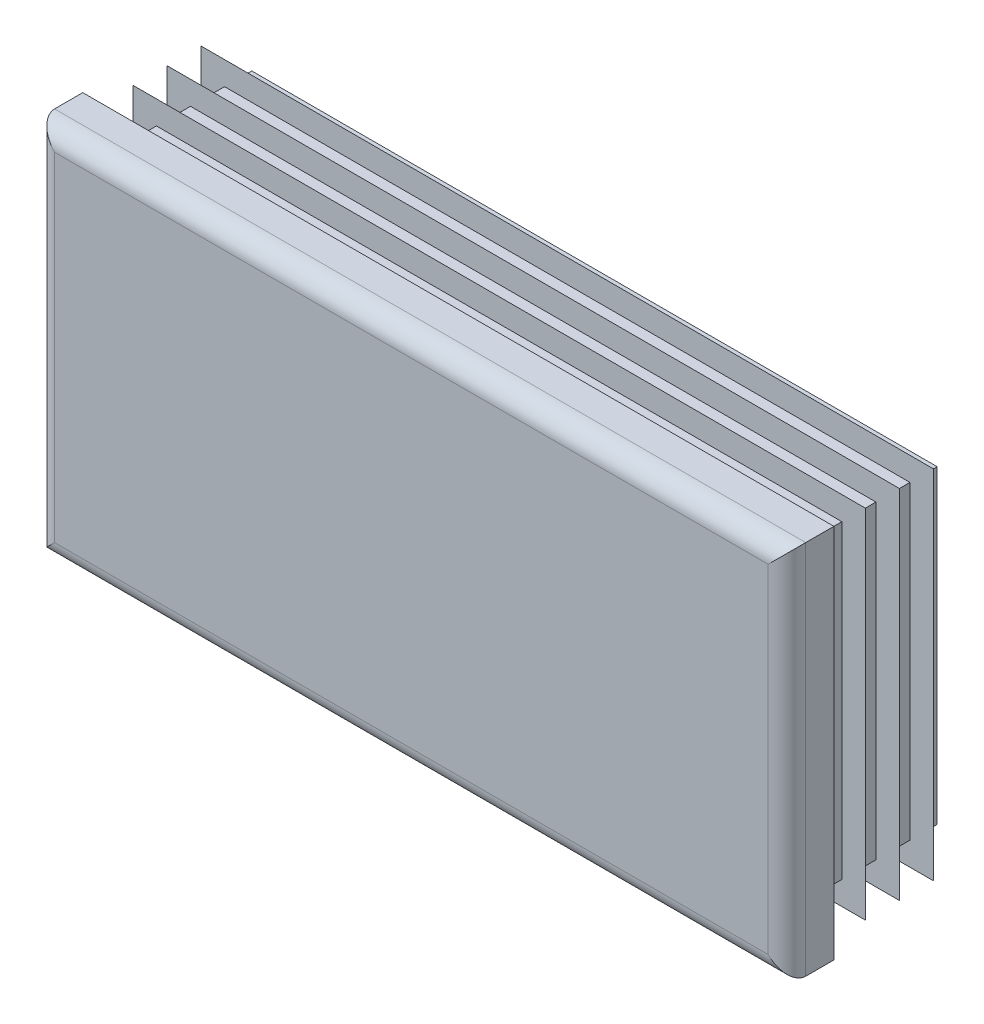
ISO-10303-21;
HEADER;
FILE_DESCRIPTION(('STEP AP214'),'2;1');
FILE_NAME('part.step','',(''),(''),'','','');
FILE_SCHEMA(('AUTOMOTIVE_DESIGN { 1 0 10303 214 1 1 1 1 }'));
ENDSEC;
DATA;
#1=APPLICATION_CONTEXT('core data for automotive mechanical design processes');
#2=APPLICATION_PROTOCOL_DEFINITION('international standard','automotive_design',2000,#1);
#3=PRODUCT_CONTEXT('',#1,'mechanical');
#4=PRODUCT('Part','Part','',(#3));
#5=PRODUCT_RELATED_PRODUCT_CATEGORY('part','',(#4));
#6=PRODUCT_DEFINITION_FORMATION('','',#4);
#7=PRODUCT_DEFINITION_CONTEXT('part definition',#1,'design');
#8=PRODUCT_DEFINITION('design','',#6,#7);
#9=PRODUCT_DEFINITION_SHAPE('','',#8);
#10=(LENGTH_UNIT() NAMED_UNIT(*) SI_UNIT(.MILLI.,.METRE.));
#11=(NAMED_UNIT(*) PLANE_ANGLE_UNIT() SI_UNIT($,.RADIAN.));
#12=(NAMED_UNIT(*) SI_UNIT($,.STERADIAN.) SOLID_ANGLE_UNIT());
#13=UNCERTAINTY_MEASURE_WITH_UNIT(LENGTH_MEASURE(1.E-05),#10,'distance_accuracy_value','');
#14=(GEOMETRIC_REPRESENTATION_CONTEXT(3) GLOBAL_UNCERTAINTY_ASSIGNED_CONTEXT((#13)) GLOBAL_UNIT_ASSIGNED_CONTEXT((#10,
#11,#12)) REPRESENTATION_CONTEXT('',''));
#15=CARTESIAN_POINT('',(0.,0.,0.));
#16=DIRECTION('',(0.,0.,1.));
#17=DIRECTION('',(1.,0.,0.));
#18=AXIS2_PLACEMENT_3D('',#15,#16,#17);
#19=CARTESIAN_POINT('',(38.,-20.,5.));
#20=DIRECTION('',(0.,0.,-1.));
#21=DIRECTION('',(0.,1.,0.));
#22=AXIS2_PLACEMENT_3D('',#19,#20,#21);
#23=PLANE('',#22);
#24=DIRECTION('',(0.,1.,0.));
#25=VECTOR('',#24,1.);
#26=CARTESIAN_POINT('',(-38.,-20.,5.));
#27=LINE('',#26,#25);
#28=CARTESIAN_POINT('',(-38.,-18.,5.));
#29=VERTEX_POINT('',#28);
#30=CARTESIAN_POINT('',(-38.,18.,5.));
#31=VERTEX_POINT('',#30);
#32=EDGE_CURVE('E310',#29,#31,#27,.T.);
#33=ORIENTED_EDGE('',*,*,#32,.F.);
#34=DIRECTION('',(-1.,0.,0.));
#35=VECTOR('',#34,1.);
#36=CARTESIAN_POINT('',(40.,-18.,5.));
#37=LINE('',#36,#35);
#38=CARTESIAN_POINT('',(38.,-18.,5.));
#39=VERTEX_POINT('',#38);
#40=EDGE_CURVE('E482',#39,#29,#37,.T.);
#41=ORIENTED_EDGE('',*,*,#40,.F.);
#42=DIRECTION('',(0.,1.,0.));
#43=VECTOR('',#42,1.);
#44=CARTESIAN_POINT('',(38.,-20.,5.));
#45=LINE('',#44,#43);
#46=CARTESIAN_POINT('',(38.,18.,5.));
#47=VERTEX_POINT('',#46);
#48=EDGE_CURVE('E305',#39,#47,#45,.T.);
#49=ORIENTED_EDGE('',*,*,#48,.T.);
#50=DIRECTION('',(-1.,0.,0.));
#51=VECTOR('',#50,1.);
#52=CARTESIAN_POINT('',(40.,18.,5.));
#53=LINE('',#52,#51);
#54=EDGE_CURVE('E630',#47,#31,#53,.T.);
#55=ORIENTED_EDGE('',*,*,#54,.T.);
#56=EDGE_LOOP('',(#33,#41,#49,#55));
#57=FACE_BOUND('',#56,.T.);
#58=ADVANCED_FACE('F14',(#57),#23,.F.);
#59=CARTESIAN_POINT('',(-38.,-20.,3.));
#60=DIRECTION('',(0.,1.,0.));
#61=DIRECTION('',(-1.,0.,0.));
#62=AXIS2_PLACEMENT_3D('',#59,#60,#61);
#63=CYLINDRICAL_SURFACE('',#62,2.);
#64=DIRECTION('',(0.,1.,0.));
#65=VECTOR('',#64,1.);
#66=CARTESIAN_POINT('',(-40.,-20.,3.));
#67=LINE('',#66,#65);
#68=CARTESIAN_POINT('',(-40.,-20.,3.));
#69=VERTEX_POINT('',#68);
#70=CARTESIAN_POINT('',(-40.,20.,3.));
#71=VERTEX_POINT('',#70);
#72=EDGE_CURVE('E402',#69,#71,#67,.T.);
#73=ORIENTED_EDGE('',*,*,#72,.F.);
#74=CARTESIAN_POINT('',(-38.,-18.,3.));
#75=DIRECTION('',(-0.707106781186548,0.707106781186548,0.));
#76=DIRECTION('',(0.707106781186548,0.707106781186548,0.));
#77=AXIS2_PLACEMENT_3D('',#74,#75,#76);
#78=ELLIPSE('',#77,2.82842712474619,2.);
#79=EDGE_CURVE('E59',#69,#29,#78,.T.);
#80=ORIENTED_EDGE('',*,*,#79,.T.);
#81=ORIENTED_EDGE('',*,*,#32,.T.);
#82=CARTESIAN_POINT('',(-38.,18.,3.));
#83=DIRECTION('',(0.707106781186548,0.707106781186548,0.));
#84=DIRECTION('',(-0.707106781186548,0.707106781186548,0.));
#85=AXIS2_PLACEMENT_3D('',#82,#83,#84);
#86=ELLIPSE('',#85,2.82842712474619,2.);
#87=EDGE_CURVE('E306',#31,#71,#86,.F.);
#88=ORIENTED_EDGE('',*,*,#87,.T.);
#89=EDGE_LOOP('',(#73,#80,#81,#88));
#90=FACE_BOUND('',#89,.T.);
#91=ADVANCED_FACE('F16',(#90),#63,.T.);
#92=CARTESIAN_POINT('',(-40.,-20.,3.));
#93=DIRECTION('',(1.,0.,0.));
#94=DIRECTION('',(0.,1.,0.));
#95=AXIS2_PLACEMENT_3D('',#92,#93,#94);
#96=PLANE('',#95);
#97=DIRECTION('',(0.,0.,-1.));
#98=VECTOR('',#97,1.);
#99=CARTESIAN_POINT('',(-40.,20.,3.));
#100=LINE('',#99,#98);
#101=CARTESIAN_POINT('',(-40.,20.,0.));
#102=VERTEX_POINT('',#101);
#103=EDGE_CURVE('E615',#71,#102,#100,.T.);
#104=ORIENTED_EDGE('',*,*,#103,.T.);
#105=DIRECTION('',(0.,1.,0.));
#106=VECTOR('',#105,1.);
#107=CARTESIAN_POINT('',(-40.,-20.,0.));
#108=LINE('',#107,#106);
#109=CARTESIAN_POINT('',(-40.,-20.,0.));
#110=VERTEX_POINT('',#109);
#111=EDGE_CURVE('E400',#110,#102,#108,.T.);
#112=ORIENTED_EDGE('',*,*,#111,.F.);
#113=DIRECTION('',(0.,0.,-1.));
#114=VECTOR('',#113,1.);
#115=CARTESIAN_POINT('',(-40.,-20.,3.));
#116=LINE('',#115,#114);
#117=EDGE_CURVE('E616',#69,#110,#116,.T.);
#118=ORIENTED_EDGE('',*,*,#117,.F.);
#119=ORIENTED_EDGE('',*,*,#72,.T.);
#120=EDGE_LOOP('',(#104,#112,#118,#119));
#121=FACE_BOUND('',#120,.T.);
#122=ADVANCED_FACE('F697',(#121),#96,.F.);
#123=CARTESIAN_POINT('',(-36.5,-20.,0.));
#124=DIRECTION('',(1.,0.,0.));
#125=DIRECTION('',(0.,1.,0.));
#126=AXIS2_PLACEMENT_3D('',#123,#124,#125);
#127=PLANE('',#126);
#128=DIRECTION('',(0.,1.,0.));
#129=VECTOR('',#128,1.);
#130=CARTESIAN_POINT('',(-36.5,-20.,0.));
#131=LINE('',#130,#129);
#132=CARTESIAN_POINT('',(-36.5,-16.5,0.));
#133=VERTEX_POINT('',#132);
#134=CARTESIAN_POINT('',(-36.5,16.5,0.));
#135=VERTEX_POINT('',#134);
#136=EDGE_CURVE('E397',#133,#135,#131,.T.);
#137=ORIENTED_EDGE('',*,*,#136,.T.);
#138=DIRECTION('',(0.,0.,-1.));
#139=VECTOR('',#138,1.);
#140=CARTESIAN_POINT('',(-36.5,16.5,0.));
#141=LINE('',#140,#139);
#142=CARTESIAN_POINT('',(-36.5,16.5,-0.725));
#143=VERTEX_POINT('',#142);
#144=EDGE_CURVE('E495',#135,#143,#141,.T.);
#145=ORIENTED_EDGE('',*,*,#144,.T.);
#146=DIRECTION('',(0.,1.,0.));
#147=VECTOR('',#146,1.);
#148=CARTESIAN_POINT('',(-36.5,-20.,-0.725));
#149=LINE('',#148,#147);
#150=CARTESIAN_POINT('',(-36.5,-16.5,-0.725));
#151=VERTEX_POINT('',#150);
#152=EDGE_CURVE('E394',#151,#143,#149,.T.);
#153=ORIENTED_EDGE('',*,*,#152,.F.);
#154=DIRECTION('',(0.,0.,1.));
#155=VECTOR('',#154,1.);
#156=CARTESIAN_POINT('',(-36.5,-16.5,0.));
#157=LINE('',#156,#155);
#158=EDGE_CURVE('E489',#151,#133,#157,.T.);
#159=ORIENTED_EDGE('',*,*,#158,.T.);
#160=EDGE_LOOP('',(#137,#145,#153,#159));
#161=FACE_BOUND('',#160,.T.);
#162=ADVANCED_FACE('F787',(#161),#127,.F.);
#163=CARTESIAN_POINT('',(-39.,-20.,-0.725));
#164=DIRECTION('',(0.34202014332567,0.,0.939692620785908));
#165=DIRECTION('',(-0.939692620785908,0.,0.34202014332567));
#166=AXIS2_PLACEMENT_3D('',#163,#164,#165);
#167=PLANE('',#166);
#168=DIRECTION('',(0.,1.,0.));
#169=VECTOR('',#168,1.);
#170=CARTESIAN_POINT('',(-39.,-20.,-0.725));
#171=LINE('',#170,#169);
#172=CARTESIAN_POINT('',(-39.,-19.,-0.725));
#173=VERTEX_POINT('',#172);
#174=CARTESIAN_POINT('',(-39.,19.,-0.725));
#175=VERTEX_POINT('',#174);
#176=EDGE_CURVE('E392',#173,#175,#171,.T.);
#177=ORIENTED_EDGE('',*,*,#176,.T.);
#178=DIRECTION('',(0.844349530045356,-0.438895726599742,-0.307318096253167));
#179=VECTOR('',#178,1.);
#180=CARTESIAN_POINT('',(-24.5473253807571,11.4874511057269,-5.98534336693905));
#181=LINE('',#180,#179);
#182=CARTESIAN_POINT('',(-36.5,17.7004915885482,-1.63492558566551));
#183=VERTEX_POINT('',#182);
#184=EDGE_CURVE('E519',#175,#183,#181,.T.);
#185=ORIENTED_EDGE('',*,*,#184,.T.);
#186=DIRECTION('',(0.,1.,0.));
#187=VECTOR('',#186,1.);
#188=CARTESIAN_POINT('',(-36.5,-20.,-1.63492558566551));
#189=LINE('',#188,#187);
#190=CARTESIAN_POINT('',(-36.5,-17.7004915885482,-1.63492558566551));
#191=VERTEX_POINT('',#190);
#192=EDGE_CURVE('E389',#191,#183,#189,.T.);
#193=ORIENTED_EDGE('',*,*,#192,.F.);
#194=DIRECTION('',(-0.844349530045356,-0.438895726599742,0.307318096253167));
#195=VECTOR('',#194,1.);
#196=CARTESIAN_POINT('',(-39.3705814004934,-19.1926294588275,-0.590119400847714));
#197=LINE('',#196,#195);
#198=EDGE_CURVE('E507',#191,#173,#197,.T.);
#199=ORIENTED_EDGE('',*,*,#198,.T.);
#200=EDGE_LOOP('',(#177,#185,#193,#199));
#201=FACE_BOUND('',#200,.T.);
#202=ADVANCED_FACE('F783',(#201),#167,.F.);
#203=CARTESIAN_POINT('',(-36.5,-20.,-1.63492558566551));
#204=DIRECTION('',(1.,0.,0.));
#205=DIRECTION('',(0.,1.,0.));
#206=AXIS2_PLACEMENT_3D('',#203,#204,#205);
#207=PLANE('',#206);
#208=ORIENTED_EDGE('',*,*,#192,.T.);
#209=DIRECTION('',(0.,-0.819152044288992,-0.573576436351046));
#210=VECTOR('',#209,1.);
#211=CARTESIAN_POINT('',(-36.5,-7.59691797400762,-19.3483624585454));
#212=LINE('',#211,#210);
#213=CARTESIAN_POINT('',(-36.5,16.5,-2.47551884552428));
#214=VERTEX_POINT('',#213);
#215=EDGE_CURVE('E516',#183,#214,#212,.T.);
#216=ORIENTED_EDGE('',*,*,#215,.T.);
#217=DIRECTION('',(0.,0.,-1.));
#218=VECTOR('',#217,1.);
#219=CARTESIAN_POINT('',(-36.5,16.5,-1.63492558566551));
#220=LINE('',#219,#218);
#221=CARTESIAN_POINT('',(-36.5,16.5,-4.35));
#222=VERTEX_POINT('',#221);
#223=EDGE_CURVE('E525',#214,#222,#220,.T.);
#224=ORIENTED_EDGE('',*,*,#223,.T.);
#225=DIRECTION('',(0.,1.,0.));
#226=VECTOR('',#225,1.);
#227=CARTESIAN_POINT('',(-36.5,-20.,-4.35));
#228=LINE('',#227,#226);
#229=CARTESIAN_POINT('',(-36.5,-16.5,-4.35));
#230=VERTEX_POINT('',#229);
#231=EDGE_CURVE('E386',#230,#222,#228,.T.);
#232=ORIENTED_EDGE('',*,*,#231,.F.);
#233=DIRECTION('',(0.,0.,1.));
#234=VECTOR('',#233,1.);
#235=CARTESIAN_POINT('',(-36.5,-16.5,-1.63492558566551));
#236=LINE('',#235,#234);
#237=CARTESIAN_POINT('',(-36.5,-16.5,-2.47551884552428));
#238=VERTEX_POINT('',#237);
#239=EDGE_CURVE('E522',#230,#238,#236,.T.);
#240=ORIENTED_EDGE('',*,*,#239,.T.);
#241=DIRECTION('',(0.,-0.819152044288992,0.573576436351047));
#242=VECTOR('',#241,1.);
#243=CARTESIAN_POINT('',(-36.5,-19.2434848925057,-0.554510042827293));
#244=LINE('',#243,#242);
#245=EDGE_CURVE('E504',#238,#191,#244,.T.);
#246=ORIENTED_EDGE('',*,*,#245,.T.);
#247=EDGE_LOOP('',(#208,#216,#224,#232,#240,#246));
#248=FACE_BOUND('',#247,.T.);
#249=ADVANCED_FACE('F779',(#248),#207,.F.);
#250=CARTESIAN_POINT('',(-39.,-20.,-4.35));
#251=DIRECTION('',(0.34202014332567,0.,0.939692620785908));
#252=DIRECTION('',(-0.939692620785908,0.,0.34202014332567));
#253=AXIS2_PLACEMENT_3D('',#250,#251,#252);
#254=PLANE('',#253);
#255=DIRECTION('',(0.,1.,0.));
#256=VECTOR('',#255,1.);
#257=CARTESIAN_POINT('',(-39.,-20.,-4.35));
#258=LINE('',#257,#256);
#259=CARTESIAN_POINT('',(-39.,-19.,-4.35));
#260=VERTEX_POINT('',#259);
#261=CARTESIAN_POINT('',(-39.,19.,-4.35));
#262=VERTEX_POINT('',#261);
#263=EDGE_CURVE('E384',#260,#262,#258,.T.);
#264=ORIENTED_EDGE('',*,*,#263,.T.);
#265=DIRECTION('',(0.844349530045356,-0.438895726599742,-0.307318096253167));
#266=VECTOR('',#265,1.);
#267=CARTESIAN_POINT('',(-24.5473253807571,11.4874511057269,-9.61034336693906));
#268=LINE('',#267,#266);
#269=CARTESIAN_POINT('',(-36.5,17.7004915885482,-5.25992558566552));
#270=VERTEX_POINT('',#269);
#271=EDGE_CURVE('E549',#262,#270,#268,.T.);
#272=ORIENTED_EDGE('',*,*,#271,.T.);
#273=DIRECTION('',(0.,1.,0.));
#274=VECTOR('',#273,1.);
#275=CARTESIAN_POINT('',(-36.5,-20.,-5.25992558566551));
#276=LINE('',#275,#274);
#277=CARTESIAN_POINT('',(-36.5,-17.7004915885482,-5.25992558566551));
#278=VERTEX_POINT('',#277);
#279=EDGE_CURVE('E381',#278,#270,#276,.T.);
#280=ORIENTED_EDGE('',*,*,#279,.F.);
#281=DIRECTION('',(-0.844349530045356,-0.438895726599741,0.307318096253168));
#282=VECTOR('',#281,1.);
#283=CARTESIAN_POINT('',(-39.3705814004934,-19.1926294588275,-4.21511940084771));
#284=LINE('',#283,#282);
#285=EDGE_CURVE('E537',#278,#260,#284,.T.);
#286=ORIENTED_EDGE('',*,*,#285,.T.);
#287=EDGE_LOOP('',(#264,#272,#280,#286));
#288=FACE_BOUND('',#287,.T.);
#289=ADVANCED_FACE('F775',(#288),#254,.F.);
#290=CARTESIAN_POINT('',(-36.5,-20.,-5.25992558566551));
#291=DIRECTION('',(1.,0.,0.));
#292=DIRECTION('',(0.,1.,0.));
#293=AXIS2_PLACEMENT_3D('',#290,#291,#292);
#294=PLANE('',#293);
#295=ORIENTED_EDGE('',*,*,#279,.T.);
#296=DIRECTION('',(0.,-0.819152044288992,-0.573576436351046));
#297=VECTOR('',#296,1.);
#298=CARTESIAN_POINT('',(-36.5,-7.59691797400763,-22.9733624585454));
#299=LINE('',#298,#297);
#300=CARTESIAN_POINT('',(-36.5,16.5,-6.10051884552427));
#301=VERTEX_POINT('',#300);
#302=EDGE_CURVE('E546',#270,#301,#299,.T.);
#303=ORIENTED_EDGE('',*,*,#302,.T.);
#304=DIRECTION('',(0.,0.,-1.));
#305=VECTOR('',#304,1.);
#306=CARTESIAN_POINT('',(-36.5,16.5,-5.25992558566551));
#307=LINE('',#306,#305);
#308=CARTESIAN_POINT('',(-36.5,16.5,-7.975));
#309=VERTEX_POINT('',#308);
#310=EDGE_CURVE('E555',#301,#309,#307,.T.);
#311=ORIENTED_EDGE('',*,*,#310,.T.);
#312=DIRECTION('',(0.,1.,0.));
#313=VECTOR('',#312,1.);
#314=CARTESIAN_POINT('',(-36.5,-20.,-7.975));
#315=LINE('',#314,#313);
#316=CARTESIAN_POINT('',(-36.5,-16.5,-7.975));
#317=VERTEX_POINT('',#316);
#318=EDGE_CURVE('E378',#317,#309,#315,.T.);
#319=ORIENTED_EDGE('',*,*,#318,.F.);
#320=DIRECTION('',(0.,0.,1.));
#321=VECTOR('',#320,1.);
#322=CARTESIAN_POINT('',(-36.5,-16.5,-5.25992558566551));
#323=LINE('',#322,#321);
#324=CARTESIAN_POINT('',(-36.5,-16.5,-6.10051884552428));
#325=VERTEX_POINT('',#324);
#326=EDGE_CURVE('E552',#317,#325,#323,.T.);
#327=ORIENTED_EDGE('',*,*,#326,.T.);
#328=DIRECTION('',(0.,-0.819152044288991,0.573576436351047));
#329=VECTOR('',#328,1.);
#330=CARTESIAN_POINT('',(-36.5,-19.2434848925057,-4.17951004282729));
#331=LINE('',#330,#329);
#332=EDGE_CURVE('E534',#325,#278,#331,.T.);
#333=ORIENTED_EDGE('',*,*,#332,.T.);
#334=EDGE_LOOP('',(#295,#303,#311,#319,#327,#333));
#335=FACE_BOUND('',#334,.T.);
#336=ADVANCED_FACE('F771',(#335),#294,.F.);
#337=CARTESIAN_POINT('',(-39.,-20.,-7.975));
#338=DIRECTION('',(0.342020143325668,0.,0.939692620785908));
#339=DIRECTION('',(-0.939692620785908,0.,0.342020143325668));
#340=AXIS2_PLACEMENT_3D('',#337,#338,#339);
#341=PLANE('',#340);
#342=DIRECTION('',(0.,1.,0.));
#343=VECTOR('',#342,1.);
#344=CARTESIAN_POINT('',(-39.,-20.,-7.975));
#345=LINE('',#344,#343);
#346=CARTESIAN_POINT('',(-39.,-19.,-7.975));
#347=VERTEX_POINT('',#346);
#348=CARTESIAN_POINT('',(-39.,19.,-7.975));
#349=VERTEX_POINT('',#348);
#350=EDGE_CURVE('E376',#347,#349,#345,.T.);
#351=ORIENTED_EDGE('',*,*,#350,.T.);
#352=DIRECTION('',(0.844349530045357,-0.43889572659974,-0.307318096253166));
#353=VECTOR('',#352,1.);
#354=CARTESIAN_POINT('',(-24.5473253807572,11.4874511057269,-13.235343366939));
#355=LINE('',#354,#353);
#356=CARTESIAN_POINT('',(-36.5,17.7004915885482,-8.88492558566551));
#357=VERTEX_POINT('',#356);
#358=EDGE_CURVE('E579',#349,#357,#355,.T.);
#359=ORIENTED_EDGE('',*,*,#358,.T.);
#360=DIRECTION('',(0.,1.,0.));
#361=VECTOR('',#360,1.);
#362=CARTESIAN_POINT('',(-36.5,-20.,-8.88492558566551));
#363=LINE('',#362,#361);
#364=CARTESIAN_POINT('',(-36.5,-17.7004915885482,-8.88492558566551));
#365=VERTEX_POINT('',#364);
#366=EDGE_CURVE('E373',#365,#357,#363,.T.);
#367=ORIENTED_EDGE('',*,*,#366,.F.);
#368=DIRECTION('',(-0.844349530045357,-0.438895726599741,0.307318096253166));
#369=VECTOR('',#368,1.);
#370=CARTESIAN_POINT('',(-39.3705814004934,-19.1926294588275,-7.84011940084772));
#371=LINE('',#370,#369);
#372=EDGE_CURVE('E567',#365,#347,#371,.T.);
#373=ORIENTED_EDGE('',*,*,#372,.T.);
#374=EDGE_LOOP('',(#351,#359,#367,#373));
#375=FACE_BOUND('',#374,.T.);
#376=ADVANCED_FACE('F767',(#375),#341,.F.);
#377=CARTESIAN_POINT('',(-36.5,-20.,-8.88492558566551));
#378=DIRECTION('',(1.,0.,0.));
#379=DIRECTION('',(0.,1.,0.));
#380=AXIS2_PLACEMENT_3D('',#377,#378,#379);
#381=PLANE('',#380);
#382=ORIENTED_EDGE('',*,*,#366,.T.);
#383=DIRECTION('',(0.,-0.819152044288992,-0.573576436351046));
#384=VECTOR('',#383,1.);
#385=CARTESIAN_POINT('',(-36.5,-7.59691797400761,-26.5983624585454));
#386=LINE('',#385,#384);
#387=CARTESIAN_POINT('',(-36.5,16.5,-9.72551884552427));
#388=VERTEX_POINT('',#387);
#389=EDGE_CURVE('E576',#357,#388,#386,.T.);
#390=ORIENTED_EDGE('',*,*,#389,.T.);
#391=DIRECTION('',(0.,0.,-1.));
#392=VECTOR('',#391,1.);
#393=CARTESIAN_POINT('',(-36.5,16.5,-8.88492558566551));
#394=LINE('',#393,#392);
#395=CARTESIAN_POINT('',(-36.5,16.5,-11.6));
#396=VERTEX_POINT('',#395);
#397=EDGE_CURVE('E585',#388,#396,#394,.T.);
#398=ORIENTED_EDGE('',*,*,#397,.T.);
#399=DIRECTION('',(0.,1.,0.));
#400=VECTOR('',#399,1.);
#401=CARTESIAN_POINT('',(-36.5,-20.,-11.6));
#402=LINE('',#401,#400);
#403=CARTESIAN_POINT('',(-36.5,-16.5,-11.6));
#404=VERTEX_POINT('',#403);
#405=EDGE_CURVE('E370',#404,#396,#402,.T.);
#406=ORIENTED_EDGE('',*,*,#405,.F.);
#407=DIRECTION('',(0.,0.,1.));
#408=VECTOR('',#407,1.);
#409=CARTESIAN_POINT('',(-36.5,-16.5,-8.88492558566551));
#410=LINE('',#409,#408);
#411=CARTESIAN_POINT('',(-36.5,-16.5,-9.72551884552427));
#412=VERTEX_POINT('',#411);
#413=EDGE_CURVE('E582',#404,#412,#410,.T.);
#414=ORIENTED_EDGE('',*,*,#413,.T.);
#415=DIRECTION('',(0.,-0.819152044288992,0.573576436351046));
#416=VECTOR('',#415,1.);
#417=CARTESIAN_POINT('',(-36.5,-19.2434848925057,-7.80451004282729));
#418=LINE('',#417,#416);
#419=EDGE_CURVE('E564',#412,#365,#418,.T.);
#420=ORIENTED_EDGE('',*,*,#419,.T.);
#421=EDGE_LOOP('',(#382,#390,#398,#406,#414,#420));
#422=FACE_BOUND('',#421,.T.);
#423=ADVANCED_FACE('F764',(#422),#381,.F.);
#424=CARTESIAN_POINT('',(-39.,-20.,-11.6));
#425=DIRECTION('',(0.342020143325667,0.,0.939692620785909));
#426=DIRECTION('',(-0.939692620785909,0.,0.342020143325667));
#427=AXIS2_PLACEMENT_3D('',#424,#425,#426);
#428=PLANE('',#427);
#429=DIRECTION('',(0.,1.,0.));
#430=VECTOR('',#429,1.);
#431=CARTESIAN_POINT('',(-39.,-20.,-11.6));
#432=LINE('',#431,#430);
#433=CARTESIAN_POINT('',(-39.,-19.,-11.6));
#434=VERTEX_POINT('',#433);
#435=CARTESIAN_POINT('',(-39.,19.,-11.6));
#436=VERTEX_POINT('',#435);
#437=EDGE_CURVE('E368',#434,#436,#432,.T.);
#438=ORIENTED_EDGE('',*,*,#437,.T.);
#439=DIRECTION('',(0.844349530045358,-0.438895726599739,-0.307318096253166));
#440=VECTOR('',#439,1.);
#441=CARTESIAN_POINT('',(-24.5473253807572,11.487451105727,-16.860343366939));
#442=LINE('',#441,#440);
#443=CARTESIAN_POINT('',(-36.5,17.7004915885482,-12.5099255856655));
#444=VERTEX_POINT('',#443);
#445=EDGE_CURVE('E607',#436,#444,#442,.T.);
#446=ORIENTED_EDGE('',*,*,#445,.T.);
#447=DIRECTION('',(0.,1.,0.));
#448=VECTOR('',#447,1.);
#449=CARTESIAN_POINT('',(-36.5,-20.,-12.5099255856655));
#450=LINE('',#449,#448);
#451=CARTESIAN_POINT('',(-36.5,-17.7004915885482,-12.5099255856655));
#452=VERTEX_POINT('',#451);
#453=EDGE_CURVE('E365',#452,#444,#450,.T.);
#454=ORIENTED_EDGE('',*,*,#453,.F.);
#455=DIRECTION('',(-0.844349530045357,-0.438895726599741,0.307318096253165));
#456=VECTOR('',#455,1.);
#457=CARTESIAN_POINT('',(-39.3705814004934,-19.1926294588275,-11.4651194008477));
#458=LINE('',#457,#456);
#459=EDGE_CURVE('E595',#452,#434,#458,.T.);
#460=ORIENTED_EDGE('',*,*,#459,.T.);
#461=EDGE_LOOP('',(#438,#446,#454,#460));
#462=FACE_BOUND('',#461,.T.);
#463=ADVANCED_FACE('F675',(#462),#428,.F.);
#464=CARTESIAN_POINT('',(-36.5,-20.,-12.5099255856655));
#465=DIRECTION('',(1.,0.,0.));
#466=DIRECTION('',(0.,1.,0.));
#467=AXIS2_PLACEMENT_3D('',#464,#465,#466);
#468=PLANE('',#467);
#469=ORIENTED_EDGE('',*,*,#453,.T.);
#470=DIRECTION('',(0.,-0.819152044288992,-0.573576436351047));
#471=VECTOR('',#470,1.);
#472=CARTESIAN_POINT('',(-36.5,-7.5969179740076,-30.2233624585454));
#473=LINE('',#472,#471);
#474=CARTESIAN_POINT('',(-36.5,16.5,-13.3505188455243));
#475=VERTEX_POINT('',#474);
#476=EDGE_CURVE('E604',#444,#475,#473,.T.);
#477=ORIENTED_EDGE('',*,*,#476,.T.);
#478=DIRECTION('',(0.,0.,-1.));
#479=VECTOR('',#478,1.);
#480=CARTESIAN_POINT('',(-36.5,16.5,-12.5099255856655));
#481=LINE('',#480,#479);
#482=CARTESIAN_POINT('',(-36.5,16.5,-14.5));
#483=VERTEX_POINT('',#482);
#484=EDGE_CURVE('E613',#475,#483,#481,.T.);
#485=ORIENTED_EDGE('',*,*,#484,.T.);
#486=DIRECTION('',(0.,1.,0.));
#487=VECTOR('',#486,1.);
#488=CARTESIAN_POINT('',(-36.5,-20.,-14.5));
#489=LINE('',#488,#487);
#490=CARTESIAN_POINT('',(-36.5,-16.5,-14.5));
#491=VERTEX_POINT('',#490);
#492=EDGE_CURVE('E362',#491,#483,#489,.T.);
#493=ORIENTED_EDGE('',*,*,#492,.F.);
#494=DIRECTION('',(0.,0.,1.));
#495=VECTOR('',#494,1.);
#496=CARTESIAN_POINT('',(-36.5,-16.5,-12.5099255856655));
#497=LINE('',#496,#495);
#498=CARTESIAN_POINT('',(-36.5,-16.5,-13.3505188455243));
#499=VERTEX_POINT('',#498);
#500=EDGE_CURVE('E610',#491,#499,#497,.T.);
#501=ORIENTED_EDGE('',*,*,#500,.T.);
#502=DIRECTION('',(0.,-0.819152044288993,0.573576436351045));
#503=VECTOR('',#502,1.);
#504=CARTESIAN_POINT('',(-36.5,-19.2434848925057,-11.4295100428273));
#505=LINE('',#504,#503);
#506=EDGE_CURVE('E592',#499,#452,#505,.T.);
#507=ORIENTED_EDGE('',*,*,#506,.T.);
#508=EDGE_LOOP('',(#469,#477,#485,#493,#501,#507));
#509=FACE_BOUND('',#508,.T.);
#510=ADVANCED_FACE('F677',(#509),#468,.F.);
#511=CARTESIAN_POINT('',(-36.5,-20.,-14.5));
#512=DIRECTION('',(0.,0.,1.));
#513=DIRECTION('',(0.,-1.,0.));
#514=AXIS2_PLACEMENT_3D('',#511,#512,#513);
#515=PLANE('',#514);
#516=ORIENTED_EDGE('',*,*,#492,.T.);
#517=DIRECTION('',(-1.,0.,0.));
#518=VECTOR('',#517,1.);
#519=CARTESIAN_POINT('',(40.,16.5,-14.5));
#520=LINE('',#519,#518);
#521=CARTESIAN_POINT('',(36.5,16.5,-14.5));
#522=VERTEX_POINT('',#521);
#523=EDGE_CURVE('E438',#522,#483,#520,.T.);
#524=ORIENTED_EDGE('',*,*,#523,.F.);
#525=DIRECTION('',(0.,1.,0.));
#526=VECTOR('',#525,1.);
#527=CARTESIAN_POINT('',(36.5,-20.,-14.5));
#528=LINE('',#527,#526);
#529=CARTESIAN_POINT('',(36.5,-16.5,-14.5));
#530=VERTEX_POINT('',#529);
#531=EDGE_CURVE('E359',#530,#522,#528,.T.);
#532=ORIENTED_EDGE('',*,*,#531,.F.);
#533=DIRECTION('',(-1.,0.,0.));
#534=VECTOR('',#533,1.);
#535=CARTESIAN_POINT('',(40.,-16.5,-14.5));
#536=LINE('',#535,#534);
#537=EDGE_CURVE('E436',#530,#491,#536,.T.);
#538=ORIENTED_EDGE('',*,*,#537,.T.);
#539=EDGE_LOOP('',(#516,#524,#532,#538));
#540=FACE_BOUND('',#539,.T.);
#541=ADVANCED_FACE('F435',(#540),#515,.F.);
#542=CARTESIAN_POINT('',(36.5,-20.,-14.5));
#543=DIRECTION('',(-1.,0.,0.));
#544=DIRECTION('',(0.,-1.,0.));
#545=AXIS2_PLACEMENT_3D('',#542,#543,#544);
#546=PLANE('',#545);
#547=DIRECTION('',(0.,0.,1.));
#548=VECTOR('',#547,1.);
#549=CARTESIAN_POINT('',(36.5,16.5,-14.5));
#550=LINE('',#549,#548);
#551=CARTESIAN_POINT('',(36.5,16.5,-13.3505188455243));
#552=VERTEX_POINT('',#551);
#553=EDGE_CURVE('E9',#522,#552,#550,.T.);
#554=ORIENTED_EDGE('',*,*,#553,.T.);
#555=DIRECTION('',(0.,0.819152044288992,0.573576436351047));
#556=VECTOR('',#555,1.);
#557=CARTESIAN_POINT('',(36.5,-8.53194709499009,-30.878076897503));
#558=LINE('',#557,#556);
#559=CARTESIAN_POINT('',(36.5,17.7004915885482,-12.5099255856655));
#560=VERTEX_POINT('',#559);
#561=EDGE_CURVE('E601',#552,#560,#558,.T.);
#562=ORIENTED_EDGE('',*,*,#561,.T.);
#563=DIRECTION('',(0.,1.,0.));
#564=VECTOR('',#563,1.);
#565=CARTESIAN_POINT('',(36.5,-20.,-12.5099255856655));
#566=LINE('',#565,#564);
#567=CARTESIAN_POINT('',(36.5,-17.7004915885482,-12.5099255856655));
#568=VERTEX_POINT('',#567);
#569=EDGE_CURVE('E356',#568,#560,#566,.T.);
#570=ORIENTED_EDGE('',*,*,#569,.F.);
#571=DIRECTION('',(0.,0.819152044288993,-0.573576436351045));
#572=VECTOR('',#571,1.);
#573=CARTESIAN_POINT('',(36.5,-18.3084557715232,-12.0842244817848));
#574=LINE('',#573,#572);
#575=CARTESIAN_POINT('',(36.5,-16.5,-13.3505188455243));
#576=VERTEX_POINT('',#575);
#577=EDGE_CURVE('E428',#568,#576,#574,.T.);
#578=ORIENTED_EDGE('',*,*,#577,.T.);
#579=DIRECTION('',(0.,0.,-1.));
#580=VECTOR('',#579,1.);
#581=CARTESIAN_POINT('',(36.5,-16.5,-14.5));
#582=LINE('',#581,#580);
#583=EDGE_CURVE('E23',#576,#530,#582,.T.);
#584=ORIENTED_EDGE('',*,*,#583,.T.);
#585=ORIENTED_EDGE('',*,*,#531,.T.);
#586=EDGE_LOOP('',(#554,#562,#570,#578,#584,#585));
#587=FACE_BOUND('',#586,.T.);
#588=ADVANCED_FACE('F426',(#587),#546,.F.);
#589=CARTESIAN_POINT('',(36.5,-20.,-12.5099255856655));
#590=DIRECTION('',(-0.342020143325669,0.,0.939692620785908));
#591=DIRECTION('',(-0.939692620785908,0.,-0.342020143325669));
#592=AXIS2_PLACEMENT_3D('',#589,#590,#591);
#593=PLANE('',#592);
#594=ORIENTED_EDGE('',*,*,#569,.T.);
#595=DIRECTION('',(0.844349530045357,0.43889572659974,0.307318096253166));
#596=VECTOR('',#595,1.);
#597=CARTESIAN_POINT('',(22.528899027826,10.4382662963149,-17.5949904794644));
#598=LINE('',#597,#596);
#599=CARTESIAN_POINT('',(39.,19.,-11.6));
#600=VERTEX_POINT('',#599);
#601=EDGE_CURVE('E598',#560,#600,#598,.T.);
#602=ORIENTED_EDGE('',*,*,#601,.T.);
#603=DIRECTION('',(0.,1.,0.));
#604=VECTOR('',#603,1.);
#605=CARTESIAN_POINT('',(39.,-20.,-11.6));
#606=LINE('',#605,#604);
#607=CARTESIAN_POINT('',(39.,-19.,-11.6));
#608=VERTEX_POINT('',#607);
#609=EDGE_CURVE('E353',#608,#600,#606,.T.);
#610=ORIENTED_EDGE('',*,*,#609,.F.);
#611=DIRECTION('',(-0.844349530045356,0.438895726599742,-0.307318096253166));
#612=VECTOR('',#611,1.);
#613=CARTESIAN_POINT('',(37.3521550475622,-18.1434446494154,-12.1997665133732));
#614=LINE('',#613,#612);
#615=EDGE_CURVE('E588',#608,#568,#614,.T.);
#616=ORIENTED_EDGE('',*,*,#615,.T.);
#617=EDGE_LOOP('',(#594,#602,#610,#616));
#618=FACE_BOUND('',#617,.T.);
#619=ADVANCED_FACE('F752',(#618),#593,.F.);
#620=CARTESIAN_POINT('',(39.,-20.,-11.6));
#621=DIRECTION('',(0.,0.,-1.));
#622=DIRECTION('',(0.,1.,0.));
#623=AXIS2_PLACEMENT_3D('',#620,#621,#622);
#624=PLANE('',#623);
#625=ORIENTED_EDGE('',*,*,#609,.T.);
#626=DIRECTION('',(-1.,0.,0.));
#627=VECTOR('',#626,1.);
#628=CARTESIAN_POINT('',(40.,19.,-11.6));
#629=LINE('',#628,#627);
#630=EDGE_CURVE('E444',#600,#436,#629,.T.);
#631=ORIENTED_EDGE('',*,*,#630,.T.);
#632=ORIENTED_EDGE('',*,*,#437,.F.);
#633=DIRECTION('',(-1.,0.,0.));
#634=VECTOR('',#633,1.);
#635=CARTESIAN_POINT('',(40.,-19.,-11.6));
#636=LINE('',#635,#634);
#637=EDGE_CURVE('E451',#608,#434,#636,.T.);
#638=ORIENTED_EDGE('',*,*,#637,.F.);
#639=EDGE_LOOP('',(#625,#631,#632,#638));
#640=FACE_BOUND('',#639,.T.);
#641=ORIENTED_EDGE('',*,*,#405,.T.);
#642=DIRECTION('',(-1.,0.,0.));
#643=VECTOR('',#642,1.);
#644=CARTESIAN_POINT('',(40.,16.5,-11.6));
#645=LINE('',#644,#643);
#646=CARTESIAN_POINT('',(36.5,16.5,-11.6));
#647=VERTEX_POINT('',#646);
#648=EDGE_CURVE('E663',#647,#396,#645,.T.);
#649=ORIENTED_EDGE('',*,*,#648,.F.);
#650=DIRECTION('',(0.,1.,0.));
#651=VECTOR('',#650,1.);
#652=CARTESIAN_POINT('',(36.5,-20.,-11.6));
#653=LINE('',#652,#651);
#654=CARTESIAN_POINT('',(36.5,-16.5,-11.6));
#655=VERTEX_POINT('',#654);
#656=EDGE_CURVE('E350',#655,#647,#653,.T.);
#657=ORIENTED_EDGE('',*,*,#656,.F.);
#658=DIRECTION('',(-1.,0.,0.));
#659=VECTOR('',#658,1.);
#660=CARTESIAN_POINT('',(40.,-16.5,-11.6));
#661=LINE('',#660,#659);
#662=EDGE_CURVE('E453',#655,#404,#661,.T.);
#663=ORIENTED_EDGE('',*,*,#662,.T.);
#664=EDGE_LOOP('',(#641,#649,#657,#663));
#665=FACE_BOUND('',#664,.T.);
#666=ADVANCED_FACE('F667',(#640,#665),#624,.F.);
#667=CARTESIAN_POINT('',(36.5,-20.,-11.6));
#668=DIRECTION('',(-1.,0.,0.));
#669=DIRECTION('',(0.,-1.,0.));
#670=AXIS2_PLACEMENT_3D('',#667,#668,#669);
#671=PLANE('',#670);
#672=DIRECTION('',(0.,0.,1.));
#673=VECTOR('',#672,1.);
#674=CARTESIAN_POINT('',(36.5,16.5,-11.6));
#675=LINE('',#674,#673);
#676=CARTESIAN_POINT('',(36.5,16.5,-9.72551884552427));
#677=VERTEX_POINT('',#676);
#678=EDGE_CURVE('E420',#647,#677,#675,.T.);
#679=ORIENTED_EDGE('',*,*,#678,.T.);
#680=DIRECTION('',(0.,0.819152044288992,0.573576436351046));
#681=VECTOR('',#680,1.);
#682=CARTESIAN_POINT('',(36.5,-8.87258567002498,-27.4915945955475));
#683=LINE('',#682,#681);
#684=CARTESIAN_POINT('',(36.5,17.7004915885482,-8.88492558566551));
#685=VERTEX_POINT('',#684);
#686=EDGE_CURVE('E573',#677,#685,#683,.T.);
#687=ORIENTED_EDGE('',*,*,#686,.T.);
#688=DIRECTION('',(0.,1.,0.));
#689=VECTOR('',#688,1.);
#690=CARTESIAN_POINT('',(36.5,-20.,-8.88492558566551));
#691=LINE('',#690,#689);
#692=CARTESIAN_POINT('',(36.5,-17.7004915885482,-8.88492558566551));
#693=VERTEX_POINT('',#692);
#694=EDGE_CURVE('E347',#693,#685,#691,.T.);
#695=ORIENTED_EDGE('',*,*,#694,.F.);
#696=DIRECTION('',(0.,0.819152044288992,-0.573576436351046));
#697=VECTOR('',#696,1.);
#698=CARTESIAN_POINT('',(36.5,-17.9678171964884,-8.69774217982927));
#699=LINE('',#698,#697);
#700=CARTESIAN_POINT('',(36.5,-16.5,-9.72551884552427));
#701=VERTEX_POINT('',#700);
#702=EDGE_CURVE('E561',#693,#701,#699,.T.);
#703=ORIENTED_EDGE('',*,*,#702,.T.);
#704=DIRECTION('',(0.,0.,-1.));
#705=VECTOR('',#704,1.);
#706=CARTESIAN_POINT('',(36.5,-16.5,-11.6));
#707=LINE('',#706,#705);
#708=EDGE_CURVE('E417',#701,#655,#707,.T.);
#709=ORIENTED_EDGE('',*,*,#708,.T.);
#710=ORIENTED_EDGE('',*,*,#656,.T.);
#711=EDGE_LOOP('',(#679,#687,#695,#703,#709,#710));
#712=FACE_BOUND('',#711,.T.);
#713=ADVANCED_FACE('F745',(#712),#671,.F.);
#714=CARTESIAN_POINT('',(36.5,-20.,-8.88492558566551));
#715=DIRECTION('',(-0.342020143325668,0.,0.939692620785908));
#716=DIRECTION('',(-0.939692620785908,0.,-0.342020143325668));
#717=AXIS2_PLACEMENT_3D('',#714,#715,#716);
#718=PLANE('',#717);
#719=ORIENTED_EDGE('',*,*,#694,.T.);
#720=DIRECTION('',(0.844349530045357,0.43889572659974,0.307318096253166));
#721=VECTOR('',#720,1.);
#722=CARTESIAN_POINT('',(22.528899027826,10.4382662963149,-13.9699904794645));
#723=LINE('',#722,#721);
#724=CARTESIAN_POINT('',(39.,19.,-7.975));
#725=VERTEX_POINT('',#724);
#726=EDGE_CURVE('E570',#685,#725,#723,.T.);
#727=ORIENTED_EDGE('',*,*,#726,.T.);
#728=DIRECTION('',(0.,1.,0.));
#729=VECTOR('',#728,1.);
#730=CARTESIAN_POINT('',(39.,-20.,-7.975));
#731=LINE('',#730,#729);
#732=CARTESIAN_POINT('',(39.,-19.,-7.975));
#733=VERTEX_POINT('',#732);
#734=EDGE_CURVE('E344',#733,#725,#731,.T.);
#735=ORIENTED_EDGE('',*,*,#734,.F.);
#736=DIRECTION('',(-0.844349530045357,0.438895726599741,-0.307318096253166));
#737=VECTOR('',#736,1.);
#738=CARTESIAN_POINT('',(37.3521550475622,-18.1434446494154,-8.57476651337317));
#739=LINE('',#738,#737);
#740=EDGE_CURVE('E558',#733,#693,#739,.T.);
#741=ORIENTED_EDGE('',*,*,#740,.T.);
#742=EDGE_LOOP('',(#719,#727,#735,#741));
#743=FACE_BOUND('',#742,.T.);
#744=ADVANCED_FACE('F741',(#743),#718,.F.);
#745=CARTESIAN_POINT('',(39.,-20.,-7.975));
#746=DIRECTION('',(0.,0.,-1.));
#747=DIRECTION('',(0.,1.,0.));
#748=AXIS2_PLACEMENT_3D('',#745,#746,#747);
#749=PLANE('',#748);
#750=ORIENTED_EDGE('',*,*,#734,.T.);
#751=DIRECTION('',(-1.,0.,0.));
#752=VECTOR('',#751,1.);
#753=CARTESIAN_POINT('',(40.,19.,-7.975));
#754=LINE('',#753,#752);
#755=EDGE_CURVE('E657',#725,#349,#754,.T.);
#756=ORIENTED_EDGE('',*,*,#755,.T.);
#757=ORIENTED_EDGE('',*,*,#350,.F.);
#758=DIRECTION('',(-1.,0.,0.));
#759=VECTOR('',#758,1.);
#760=CARTESIAN_POINT('',(40.,-19.,-7.975));
#761=LINE('',#760,#759);
#762=EDGE_CURVE('E459',#733,#347,#761,.T.);
#763=ORIENTED_EDGE('',*,*,#762,.F.);
#764=EDGE_LOOP('',(#750,#756,#757,#763));
#765=FACE_BOUND('',#764,.T.);
#766=ORIENTED_EDGE('',*,*,#318,.T.);
#767=DIRECTION('',(-1.,0.,0.));
#768=VECTOR('',#767,1.);
#769=CARTESIAN_POINT('',(40.,16.5,-7.975));
#770=LINE('',#769,#768);
#771=CARTESIAN_POINT('',(36.5,16.5,-7.975));
#772=VERTEX_POINT('',#771);
#773=EDGE_CURVE('E655',#772,#309,#770,.T.);
#774=ORIENTED_EDGE('',*,*,#773,.F.);
#775=DIRECTION('',(0.,1.,0.));
#776=VECTOR('',#775,1.);
#777=CARTESIAN_POINT('',(36.5,-20.,-7.975));
#778=LINE('',#777,#776);
#779=CARTESIAN_POINT('',(36.5,-16.5,-7.975));
#780=VERTEX_POINT('',#779);
#781=EDGE_CURVE('E341',#780,#772,#778,.T.);
#782=ORIENTED_EDGE('',*,*,#781,.F.);
#783=DIRECTION('',(-1.,0.,0.));
#784=VECTOR('',#783,1.);
#785=CARTESIAN_POINT('',(40.,-16.5,-7.975));
#786=LINE('',#785,#784);
#787=EDGE_CURVE('E461',#780,#317,#786,.T.);
#788=ORIENTED_EDGE('',*,*,#787,.T.);
#789=EDGE_LOOP('',(#766,#774,#782,#788));
#790=FACE_BOUND('',#789,.T.);
#791=ADVANCED_FACE('F737',(#765,#790),#749,.F.);
#792=CARTESIAN_POINT('',(36.5,-20.,-7.975));
#793=DIRECTION('',(-1.,0.,0.));
#794=DIRECTION('',(0.,-1.,0.));
#795=AXIS2_PLACEMENT_3D('',#792,#793,#794);
#796=PLANE('',#795);
#797=DIRECTION('',(0.,0.,1.));
#798=VECTOR('',#797,1.);
#799=CARTESIAN_POINT('',(36.5,16.5,-7.975));
#800=LINE('',#799,#798);
#801=CARTESIAN_POINT('',(36.5,16.5,-6.10051884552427));
#802=VERTEX_POINT('',#801);
#803=EDGE_CURVE('E414',#772,#802,#800,.T.);
#804=ORIENTED_EDGE('',*,*,#803,.T.);
#805=DIRECTION('',(0.,0.819152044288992,0.573576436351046));
#806=VECTOR('',#805,1.);
#807=CARTESIAN_POINT('',(36.5,-8.872585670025,-23.8665945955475));
#808=LINE('',#807,#806);
#809=CARTESIAN_POINT('',(36.5,17.7004915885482,-5.25992558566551));
#810=VERTEX_POINT('',#809);
#811=EDGE_CURVE('E543',#802,#810,#808,.T.);
#812=ORIENTED_EDGE('',*,*,#811,.T.);
#813=DIRECTION('',(0.,1.,0.));
#814=VECTOR('',#813,1.);
#815=CARTESIAN_POINT('',(36.5,-20.,-5.25992558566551));
#816=LINE('',#815,#814);
#817=CARTESIAN_POINT('',(36.5,-17.7004915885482,-5.25992558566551));
#818=VERTEX_POINT('',#817);
#819=EDGE_CURVE('E338',#818,#810,#816,.T.);
#820=ORIENTED_EDGE('',*,*,#819,.F.);
#821=DIRECTION('',(0.,0.819152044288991,-0.573576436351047));
#822=VECTOR('',#821,1.);
#823=CARTESIAN_POINT('',(36.5,-17.9678171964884,-5.07274217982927));
#824=LINE('',#823,#822);
#825=CARTESIAN_POINT('',(36.5,-16.5,-6.10051884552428));
#826=VERTEX_POINT('',#825);
#827=EDGE_CURVE('E531',#818,#826,#824,.T.);
#828=ORIENTED_EDGE('',*,*,#827,.T.);
#829=DIRECTION('',(0.,0.,-1.));
#830=VECTOR('',#829,1.);
#831=CARTESIAN_POINT('',(36.5,-16.5,-7.975));
#832=LINE('',#831,#830);
#833=EDGE_CURVE('E411',#826,#780,#832,.T.);
#834=ORIENTED_EDGE('',*,*,#833,.T.);
#835=ORIENTED_EDGE('',*,*,#781,.T.);
#836=EDGE_LOOP('',(#804,#812,#820,#828,#834,#835));
#837=FACE_BOUND('',#836,.T.);
#838=ADVANCED_FACE('F733',(#837),#796,.F.);
#839=CARTESIAN_POINT('',(36.5,-20.,-5.25992558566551));
#840=DIRECTION('',(-0.342020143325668,0.,0.939692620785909));
#841=DIRECTION('',(-0.939692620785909,0.,-0.342020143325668));
#842=AXIS2_PLACEMENT_3D('',#839,#840,#841);
#843=PLANE('',#842);
#844=ORIENTED_EDGE('',*,*,#819,.T.);
#845=DIRECTION('',(0.844349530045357,0.43889572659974,0.307318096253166));
#846=VECTOR('',#845,1.);
#847=CARTESIAN_POINT('',(22.528899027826,10.4382662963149,-10.3449904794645));
#848=LINE('',#847,#846);
#849=CARTESIAN_POINT('',(39.,19.,-4.35));
#850=VERTEX_POINT('',#849);
#851=EDGE_CURVE('E540',#810,#850,#848,.T.);
#852=ORIENTED_EDGE('',*,*,#851,.T.);
#853=DIRECTION('',(0.,1.,0.));
#854=VECTOR('',#853,1.);
#855=CARTESIAN_POINT('',(39.,-20.,-4.35));
#856=LINE('',#855,#854);
#857=CARTESIAN_POINT('',(39.,-19.,-4.35));
#858=VERTEX_POINT('',#857);
#859=EDGE_CURVE('E335',#858,#850,#856,.T.);
#860=ORIENTED_EDGE('',*,*,#859,.F.);
#861=DIRECTION('',(-0.844349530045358,0.438895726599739,-0.307318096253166));
#862=VECTOR('',#861,1.);
#863=CARTESIAN_POINT('',(37.3521550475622,-18.1434446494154,-4.94976651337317));
#864=LINE('',#863,#862);
#865=EDGE_CURVE('E528',#858,#818,#864,.T.);
#866=ORIENTED_EDGE('',*,*,#865,.T.);
#867=EDGE_LOOP('',(#844,#852,#860,#866));
#868=FACE_BOUND('',#867,.T.);
#869=ADVANCED_FACE('F729',(#868),#843,.F.);
#870=CARTESIAN_POINT('',(39.,-20.,-4.35));
#871=DIRECTION('',(0.,0.,-1.));
#872=DIRECTION('',(0.,1.,0.));
#873=AXIS2_PLACEMENT_3D('',#870,#871,#872);
#874=PLANE('',#873);
#875=ORIENTED_EDGE('',*,*,#859,.T.);
#876=DIRECTION('',(-1.,0.,0.));
#877=VECTOR('',#876,1.);
#878=CARTESIAN_POINT('',(40.,19.,-4.35));
#879=LINE('',#878,#877);
#880=EDGE_CURVE('E649',#850,#262,#879,.T.);
#881=ORIENTED_EDGE('',*,*,#880,.T.);
#882=ORIENTED_EDGE('',*,*,#263,.F.);
#883=DIRECTION('',(-1.,0.,0.));
#884=VECTOR('',#883,1.);
#885=CARTESIAN_POINT('',(40.,-19.,-4.35));
#886=LINE('',#885,#884);
#887=EDGE_CURVE('E467',#858,#260,#886,.T.);
#888=ORIENTED_EDGE('',*,*,#887,.F.);
#889=EDGE_LOOP('',(#875,#881,#882,#888));
#890=FACE_BOUND('',#889,.T.);
#891=ORIENTED_EDGE('',*,*,#231,.T.);
#892=DIRECTION('',(-1.,0.,0.));
#893=VECTOR('',#892,1.);
#894=CARTESIAN_POINT('',(40.,16.5,-4.35));
#895=LINE('',#894,#893);
#896=CARTESIAN_POINT('',(36.5,16.5,-4.35));
#897=VERTEX_POINT('',#896);
#898=EDGE_CURVE('E647',#897,#222,#895,.T.);
#899=ORIENTED_EDGE('',*,*,#898,.F.);
#900=DIRECTION('',(0.,1.,0.));
#901=VECTOR('',#900,1.);
#902=CARTESIAN_POINT('',(36.5,-20.,-4.35));
#903=LINE('',#902,#901);
#904=CARTESIAN_POINT('',(36.5,-16.5,-4.35));
#905=VERTEX_POINT('',#904);
#906=EDGE_CURVE('E332',#905,#897,#903,.T.);
#907=ORIENTED_EDGE('',*,*,#906,.F.);
#908=DIRECTION('',(-1.,0.,0.));
#909=VECTOR('',#908,1.);
#910=CARTESIAN_POINT('',(40.,-16.5,-4.35));
#911=LINE('',#910,#909);
#912=EDGE_CURVE('E469',#905,#230,#911,.T.);
#913=ORIENTED_EDGE('',*,*,#912,.T.);
#914=EDGE_LOOP('',(#891,#899,#907,#913));
#915=FACE_BOUND('',#914,.T.);
#916=ADVANCED_FACE('F725',(#890,#915),#874,.F.);
#917=CARTESIAN_POINT('',(36.5,-20.,-4.35));
#918=DIRECTION('',(-1.,0.,0.));
#919=DIRECTION('',(0.,-1.,0.));
#920=AXIS2_PLACEMENT_3D('',#917,#918,#919);
#921=PLANE('',#920);
#922=DIRECTION('',(0.,0.,1.));
#923=VECTOR('',#922,1.);
#924=CARTESIAN_POINT('',(36.5,16.5,-4.35));
#925=LINE('',#924,#923);
#926=CARTESIAN_POINT('',(36.5,16.5,-2.47551884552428));
#927=VERTEX_POINT('',#926);
#928=EDGE_CURVE('E408',#897,#927,#925,.T.);
#929=ORIENTED_EDGE('',*,*,#928,.T.);
#930=DIRECTION('',(0.,0.819152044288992,0.573576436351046));
#931=VECTOR('',#930,1.);
#932=CARTESIAN_POINT('',(36.5,-8.872585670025,-20.2415945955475));
#933=LINE('',#932,#931);
#934=CARTESIAN_POINT('',(36.5,17.7004915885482,-1.6349255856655));
#935=VERTEX_POINT('',#934);
#936=EDGE_CURVE('E513',#927,#935,#933,.T.);
#937=ORIENTED_EDGE('',*,*,#936,.T.);
#938=DIRECTION('',(0.,1.,0.));
#939=VECTOR('',#938,1.);
#940=CARTESIAN_POINT('',(36.5,-20.,-1.6349255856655));
#941=LINE('',#940,#939);
#942=CARTESIAN_POINT('',(36.5,-17.7004915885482,-1.6349255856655));
#943=VERTEX_POINT('',#942);
#944=EDGE_CURVE('E329',#943,#935,#941,.T.);
#945=ORIENTED_EDGE('',*,*,#944,.F.);
#946=DIRECTION('',(0.,0.819152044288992,-0.573576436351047));
#947=VECTOR('',#946,1.);
#948=CARTESIAN_POINT('',(36.5,-17.9678171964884,-1.44774217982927));
#949=LINE('',#948,#947);
#950=CARTESIAN_POINT('',(36.5,-16.5,-2.47551884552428));
#951=VERTEX_POINT('',#950);
#952=EDGE_CURVE('E501',#943,#951,#949,.T.);
#953=ORIENTED_EDGE('',*,*,#952,.T.);
#954=DIRECTION('',(0.,0.,-1.));
#955=VECTOR('',#954,1.);
#956=CARTESIAN_POINT('',(36.5,-16.5,-4.35));
#957=LINE('',#956,#955);
#958=EDGE_CURVE('E405',#951,#905,#957,.T.);
#959=ORIENTED_EDGE('',*,*,#958,.T.);
#960=ORIENTED_EDGE('',*,*,#906,.T.);
#961=EDGE_LOOP('',(#929,#937,#945,#953,#959,#960));
#962=FACE_BOUND('',#961,.T.);
#963=ADVANCED_FACE('F721',(#962),#921,.F.);
#964=CARTESIAN_POINT('',(36.5,-20.,-1.6349255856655));
#965=DIRECTION('',(-0.342020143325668,0.,0.939692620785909));
#966=DIRECTION('',(-0.939692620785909,0.,-0.342020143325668));
#967=AXIS2_PLACEMENT_3D('',#964,#965,#966);
#968=PLANE('',#967);
#969=ORIENTED_EDGE('',*,*,#944,.T.);
#970=DIRECTION('',(0.844349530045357,0.43889572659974,0.307318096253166));
#971=VECTOR('',#970,1.);
#972=CARTESIAN_POINT('',(22.528899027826,10.4382662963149,-6.71999047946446));
#973=LINE('',#972,#971);
#974=CARTESIAN_POINT('',(39.,19.,-0.725));
#975=VERTEX_POINT('',#974);
#976=EDGE_CURVE('E510',#935,#975,#973,.T.);
#977=ORIENTED_EDGE('',*,*,#976,.T.);
#978=DIRECTION('',(0.,1.,0.));
#979=VECTOR('',#978,1.);
#980=CARTESIAN_POINT('',(39.,-20.,-0.725));
#981=LINE('',#980,#979);
#982=CARTESIAN_POINT('',(39.,-19.,-0.725));
#983=VERTEX_POINT('',#982);
#984=EDGE_CURVE('E326',#983,#975,#981,.T.);
#985=ORIENTED_EDGE('',*,*,#984,.F.);
#986=DIRECTION('',(-0.844349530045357,0.43889572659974,-0.307318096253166));
#987=VECTOR('',#986,1.);
#988=CARTESIAN_POINT('',(37.3521550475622,-18.1434446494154,-1.32476651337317));
#989=LINE('',#988,#987);
#990=EDGE_CURVE('E498',#983,#943,#989,.T.);
#991=ORIENTED_EDGE('',*,*,#990,.T.);
#992=EDGE_LOOP('',(#969,#977,#985,#991));
#993=FACE_BOUND('',#992,.T.);
#994=ADVANCED_FACE('F717',(#993),#968,.F.);
#995=CARTESIAN_POINT('',(39.,-20.,-0.725));
#996=DIRECTION('',(0.,0.,-1.));
#997=DIRECTION('',(0.,1.,0.));
#998=AXIS2_PLACEMENT_3D('',#995,#996,#997);
#999=PLANE('',#998);
#1000=ORIENTED_EDGE('',*,*,#984,.T.);
#1001=DIRECTION('',(-1.,0.,0.));
#1002=VECTOR('',#1001,1.);
#1003=CARTESIAN_POINT('',(40.,19.,-0.725));
#1004=LINE('',#1003,#1002);
#1005=EDGE_CURVE('E641',#975,#175,#1004,.T.);
#1006=ORIENTED_EDGE('',*,*,#1005,.T.);
#1007=ORIENTED_EDGE('',*,*,#176,.F.);
#1008=DIRECTION('',(-1.,0.,0.));
#1009=VECTOR('',#1008,1.);
#1010=CARTESIAN_POINT('',(40.,-19.,-0.725));
#1011=LINE('',#1010,#1009);
#1012=EDGE_CURVE('E475',#983,#173,#1011,.T.);
#1013=ORIENTED_EDGE('',*,*,#1012,.F.);
#1014=EDGE_LOOP('',(#1000,#1006,#1007,#1013));
#1015=FACE_BOUND('',#1014,.T.);
#1016=ORIENTED_EDGE('',*,*,#152,.T.);
#1017=DIRECTION('',(-1.,0.,0.));
#1018=VECTOR('',#1017,1.);
#1019=CARTESIAN_POINT('',(40.,16.5,-0.725));
#1020=LINE('',#1019,#1018);
#1021=CARTESIAN_POINT('',(36.5,16.5,-0.725));
#1022=VERTEX_POINT('',#1021);
#1023=EDGE_CURVE('E639',#1022,#143,#1020,.T.);
#1024=ORIENTED_EDGE('',*,*,#1023,.F.);
#1025=DIRECTION('',(0.,1.,0.));
#1026=VECTOR('',#1025,1.);
#1027=CARTESIAN_POINT('',(36.5,-20.,-0.725));
#1028=LINE('',#1027,#1026);
#1029=CARTESIAN_POINT('',(36.5,-16.5,-0.725));
#1030=VERTEX_POINT('',#1029);
#1031=EDGE_CURVE('E323',#1030,#1022,#1028,.T.);
#1032=ORIENTED_EDGE('',*,*,#1031,.F.);
#1033=DIRECTION('',(-1.,0.,0.));
#1034=VECTOR('',#1033,1.);
#1035=CARTESIAN_POINT('',(40.,-16.5,-0.725));
#1036=LINE('',#1035,#1034);
#1037=EDGE_CURVE('E477',#1030,#151,#1036,.T.);
#1038=ORIENTED_EDGE('',*,*,#1037,.T.);
#1039=EDGE_LOOP('',(#1016,#1024,#1032,#1038));
#1040=FACE_BOUND('',#1039,.T.);
#1041=ADVANCED_FACE('F713',(#1015,#1040),#999,.F.);
#1042=CARTESIAN_POINT('',(36.5,-20.,-0.725));
#1043=DIRECTION('',(-1.,0.,0.));
#1044=DIRECTION('',(0.,-1.,0.));
#1045=AXIS2_PLACEMENT_3D('',#1042,#1043,#1044);
#1046=PLANE('',#1045);
#1047=ORIENTED_EDGE('',*,*,#1031,.T.);
#1048=DIRECTION('',(0.,0.,1.));
#1049=VECTOR('',#1048,1.);
#1050=CARTESIAN_POINT('',(36.5,16.5,-0.725));
#1051=LINE('',#1050,#1049);
#1052=CARTESIAN_POINT('',(36.5,16.5,0.));
#1053=VERTEX_POINT('',#1052);
#1054=EDGE_CURVE('E492',#1022,#1053,#1051,.T.);
#1055=ORIENTED_EDGE('',*,*,#1054,.T.);
#1056=DIRECTION('',(0.,1.,0.));
#1057=VECTOR('',#1056,1.);
#1058=CARTESIAN_POINT('',(36.5,-20.,0.));
#1059=LINE('',#1058,#1057);
#1060=CARTESIAN_POINT('',(36.5,-16.5,0.));
#1061=VERTEX_POINT('',#1060);
#1062=EDGE_CURVE('E316',#1061,#1053,#1059,.T.);
#1063=ORIENTED_EDGE('',*,*,#1062,.F.);
#1064=DIRECTION('',(0.,0.,-1.));
#1065=VECTOR('',#1064,1.);
#1066=CARTESIAN_POINT('',(36.5,-16.5,-0.725));
#1067=LINE('',#1066,#1065);
#1068=EDGE_CURVE('E486',#1061,#1030,#1067,.T.);
#1069=ORIENTED_EDGE('',*,*,#1068,.T.);
#1070=EDGE_LOOP('',(#1047,#1055,#1063,#1069));
#1071=FACE_BOUND('',#1070,.T.);
#1072=ADVANCED_FACE('F709',(#1071),#1046,.F.);
#1073=CARTESIAN_POINT('',(36.5,-20.,0.));
#1074=DIRECTION('',(0.,0.,1.));
#1075=DIRECTION('',(-1.,0.,0.));
#1076=AXIS2_PLACEMENT_3D('',#1073,#1074,#1075);
#1077=PLANE('',#1076);
#1078=DIRECTION('',(-1.,0.,0.));
#1079=VECTOR('',#1078,1.);
#1080=CARTESIAN_POINT('',(40.,16.5,0.));
#1081=LINE('',#1080,#1079);
#1082=EDGE_CURVE('E634',#1053,#135,#1081,.T.);
#1083=ORIENTED_EDGE('',*,*,#1082,.T.);
#1084=ORIENTED_EDGE('',*,*,#136,.F.);
#1085=DIRECTION('',(-1.,0.,0.));
#1086=VECTOR('',#1085,1.);
#1087=CARTESIAN_POINT('',(40.,-16.5,0.));
#1088=LINE('',#1087,#1086);
#1089=EDGE_CURVE('E296',#1061,#133,#1088,.T.);
#1090=ORIENTED_EDGE('',*,*,#1089,.F.);
#1091=ORIENTED_EDGE('',*,*,#1062,.T.);
#1092=EDGE_LOOP('',(#1083,#1084,#1090,#1091));
#1093=FACE_BOUND('',#1092,.T.);
#1094=ORIENTED_EDGE('',*,*,#111,.T.);
#1095=DIRECTION('',(1.,0.,0.));
#1096=VECTOR('',#1095,1.);
#1097=CARTESIAN_POINT('',(36.5,20.,0.));
#1098=LINE('',#1097,#1096);
#1099=CARTESIAN_POINT('',(40.,20.,0.));
#1100=VERTEX_POINT('',#1099);
#1101=EDGE_CURVE('E621',#102,#1100,#1098,.T.);
#1102=ORIENTED_EDGE('',*,*,#1101,.T.);
#1103=DIRECTION('',(0.,1.,0.));
#1104=VECTOR('',#1103,1.);
#1105=CARTESIAN_POINT('',(40.,-20.,0.));
#1106=LINE('',#1105,#1104);
#1107=CARTESIAN_POINT('',(40.,-20.,0.));
#1108=VERTEX_POINT('',#1107);
#1109=EDGE_CURVE('E45',#1108,#1100,#1106,.T.);
#1110=ORIENTED_EDGE('',*,*,#1109,.F.);
#1111=DIRECTION('',(1.,0.,0.));
#1112=VECTOR('',#1111,1.);
#1113=CARTESIAN_POINT('',(-40.,-20.,0.));
#1114=LINE('',#1113,#1112);
#1115=EDGE_CURVE('E31',#110,#1108,#1114,.T.);
#1116=ORIENTED_EDGE('',*,*,#1115,.F.);
#1117=EDGE_LOOP('',(#1094,#1102,#1110,#1116));
#1118=FACE_BOUND('',#1117,.T.);
#1119=ADVANCED_FACE('F706',(#1093,#1118),#1077,.F.);
#1120=CARTESIAN_POINT('',(40.,-20.,0.));
#1121=DIRECTION('',(-1.,0.,0.));
#1122=DIRECTION('',(0.,-1.,0.));
#1123=AXIS2_PLACEMENT_3D('',#1120,#1121,#1122);
#1124=PLANE('',#1123);
#1125=DIRECTION('',(0.,0.,1.));
#1126=VECTOR('',#1125,1.);
#1127=CARTESIAN_POINT('',(40.,20.,0.));
#1128=LINE('',#1127,#1126);
#1129=CARTESIAN_POINT('',(40.,20.,3.));
#1130=VERTEX_POINT('',#1129);
#1131=EDGE_CURVE('E314',#1100,#1130,#1128,.T.);
#1132=ORIENTED_EDGE('',*,*,#1131,.T.);
#1133=DIRECTION('',(0.,1.,0.));
#1134=VECTOR('',#1133,1.);
#1135=CARTESIAN_POINT('',(40.,-20.,3.));
#1136=LINE('',#1135,#1134);
#1137=CARTESIAN_POINT('',(40.,-20.,3.));
#1138=VERTEX_POINT('',#1137);
#1139=EDGE_CURVE('E303',#1138,#1130,#1136,.T.);
#1140=ORIENTED_EDGE('',*,*,#1139,.F.);
#1141=DIRECTION('',(0.,0.,1.));
#1142=VECTOR('',#1141,1.);
#1143=CARTESIAN_POINT('',(40.,-20.,0.));
#1144=LINE('',#1143,#1142);
#1145=EDGE_CURVE('E308',#1108,#1138,#1144,.T.);
#1146=ORIENTED_EDGE('',*,*,#1145,.F.);
#1147=ORIENTED_EDGE('',*,*,#1109,.T.);
#1148=EDGE_LOOP('',(#1132,#1140,#1146,#1147));
#1149=FACE_BOUND('',#1148,.T.);
#1150=ADVANCED_FACE('F312',(#1149),#1124,.F.);
#1151=CARTESIAN_POINT('',(38.,-20.,3.));
#1152=DIRECTION('',(0.,1.,0.));
#1153=DIRECTION('',(-1.,0.,0.));
#1154=AXIS2_PLACEMENT_3D('',#1151,#1152,#1153);
#1155=CYLINDRICAL_SURFACE('',#1154,2.);
#1156=ORIENTED_EDGE('',*,*,#48,.F.);
#1157=CARTESIAN_POINT('',(38.,-18.,3.));
#1158=DIRECTION('',(0.707106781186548,0.707106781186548,0.));
#1159=DIRECTION('',(-0.707106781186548,0.707106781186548,0.));
#1160=AXIS2_PLACEMENT_3D('',#1157,#1158,#1159);
#1161=ELLIPSE('',#1160,2.82842712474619,2.);
#1162=EDGE_CURVE('E293',#39,#1138,#1161,.T.);
#1163=ORIENTED_EDGE('',*,*,#1162,.T.);
#1164=ORIENTED_EDGE('',*,*,#1139,.T.);
#1165=CARTESIAN_POINT('',(38.,18.,3.));
#1166=DIRECTION('',(-0.707106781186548,0.707106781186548,0.));
#1167=DIRECTION('',(0.707106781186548,0.707106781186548,0.));
#1168=AXIS2_PLACEMENT_3D('',#1165,#1166,#1167);
#1169=ELLIPSE('',#1168,2.82842712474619,2.);
#1170=EDGE_CURVE('E52',#1130,#47,#1169,.F.);
#1171=ORIENTED_EDGE('',*,*,#1170,.T.);
#1172=EDGE_LOOP('',(#1156,#1163,#1164,#1171));
#1173=FACE_BOUND('',#1172,.T.);
#1174=ADVANCED_FACE('F301',(#1173),#1155,.T.);
#1175=CARTESIAN_POINT('',(-38.,-20.,3.));
#1176=DIRECTION('',(0.,-1.,0.));
#1177=DIRECTION('',(1.,0.,0.));
#1178=AXIS2_PLACEMENT_3D('',#1175,#1176,#1177);
#1179=PLANE('',#1178);
#1180=DIRECTION('',(-1.,0.,0.));
#1181=VECTOR('',#1180,1.);
#1182=CARTESIAN_POINT('',(40.,-20.,3.));
#1183=LINE('',#1182,#1181);
#1184=EDGE_CURVE('E290',#1138,#69,#1183,.T.);
#1185=ORIENTED_EDGE('',*,*,#1184,.T.);
#1186=ORIENTED_EDGE('',*,*,#117,.T.);
#1187=ORIENTED_EDGE('',*,*,#1115,.T.);
#1188=ORIENTED_EDGE('',*,*,#1145,.T.);
#1189=EDGE_LOOP('',(#1185,#1186,#1187,#1188));
#1190=FACE_BOUND('',#1189,.T.);
#1191=ADVANCED_FACE('F309',(#1190),#1179,.T.);
#1192=CARTESIAN_POINT('',(-38.,20.,3.));
#1193=DIRECTION('',(0.,-1.,0.));
#1194=DIRECTION('',(1.,0.,0.));
#1195=AXIS2_PLACEMENT_3D('',#1192,#1193,#1194);
#1196=PLANE('',#1195);
#1197=ORIENTED_EDGE('',*,*,#103,.F.);
#1198=DIRECTION('',(-1.,0.,0.));
#1199=VECTOR('',#1198,1.);
#1200=CARTESIAN_POINT('',(40.,20.,3.));
#1201=LINE('',#1200,#1199);
#1202=EDGE_CURVE('E631',#1130,#71,#1201,.T.);
#1203=ORIENTED_EDGE('',*,*,#1202,.F.);
#1204=ORIENTED_EDGE('',*,*,#1131,.F.);
#1205=ORIENTED_EDGE('',*,*,#1101,.F.);
#1206=EDGE_LOOP('',(#1197,#1203,#1204,#1205));
#1207=FACE_BOUND('',#1206,.T.);
#1208=ADVANCED_FACE('F700',(#1207),#1196,.F.);
#1209=CARTESIAN_POINT('',(40.,16.5,-0.725));
#1210=DIRECTION('',(0.,-1.,0.));
#1211=DIRECTION('',(1.,0.,0.));
#1212=AXIS2_PLACEMENT_3D('',#1209,#1210,#1211);
#1213=PLANE('',#1212);
#1214=ORIENTED_EDGE('',*,*,#1082,.F.);
#1215=ORIENTED_EDGE('',*,*,#1054,.F.);
#1216=ORIENTED_EDGE('',*,*,#1023,.T.);
#1217=ORIENTED_EDGE('',*,*,#144,.F.);
#1218=EDGE_LOOP('',(#1214,#1215,#1216,#1217));
#1219=FACE_BOUND('',#1218,.T.);
#1220=ADVANCED_FACE('F812',(#1219),#1213,.F.);
#1221=CARTESIAN_POINT('',(40.,16.5,-2.47551884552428));
#1222=DIRECTION('',(0.,-0.573576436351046,0.819152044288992));
#1223=DIRECTION('',(0.,-0.819152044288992,-0.573576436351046));
#1224=AXIS2_PLACEMENT_3D('',#1221,#1222,#1223);
#1225=PLANE('',#1224);
#1226=ORIENTED_EDGE('',*,*,#1005,.F.);
#1227=ORIENTED_EDGE('',*,*,#976,.F.);
#1228=ORIENTED_EDGE('',*,*,#936,.F.);
#1229=DIRECTION('',(-1.,0.,0.));
#1230=VECTOR('',#1229,1.);
#1231=CARTESIAN_POINT('',(40.,16.5,-2.47551884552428));
#1232=LINE('',#1231,#1230);
#1233=EDGE_CURVE('E644',#927,#214,#1232,.T.);
#1234=ORIENTED_EDGE('',*,*,#1233,.T.);
#1235=ORIENTED_EDGE('',*,*,#215,.F.);
#1236=ORIENTED_EDGE('',*,*,#184,.F.);
#1237=EDGE_LOOP('',(#1226,#1227,#1228,#1234,#1235,#1236));
#1238=FACE_BOUND('',#1237,.T.);
#1239=ADVANCED_FACE('F815',(#1238),#1225,.F.);
#1240=CARTESIAN_POINT('',(40.,16.5,-4.35));
#1241=DIRECTION('',(0.,-1.,0.));
#1242=DIRECTION('',(1.,0.,0.));
#1243=AXIS2_PLACEMENT_3D('',#1240,#1241,#1242);
#1244=PLANE('',#1243);
#1245=ORIENTED_EDGE('',*,*,#1233,.F.);
#1246=ORIENTED_EDGE('',*,*,#928,.F.);
#1247=ORIENTED_EDGE('',*,*,#898,.T.);
#1248=ORIENTED_EDGE('',*,*,#223,.F.);
#1249=EDGE_LOOP('',(#1245,#1246,#1247,#1248));
#1250=FACE_BOUND('',#1249,.T.);
#1251=ADVANCED_FACE('F819',(#1250),#1244,.F.);
#1252=CARTESIAN_POINT('',(40.,16.5,-6.10051884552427));
#1253=DIRECTION('',(0.,-0.573576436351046,0.819152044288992));
#1254=DIRECTION('',(0.,-0.819152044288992,-0.573576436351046));
#1255=AXIS2_PLACEMENT_3D('',#1252,#1253,#1254);
#1256=PLANE('',#1255);
#1257=ORIENTED_EDGE('',*,*,#880,.F.);
#1258=ORIENTED_EDGE('',*,*,#851,.F.);
#1259=ORIENTED_EDGE('',*,*,#811,.F.);
#1260=DIRECTION('',(-1.,0.,0.));
#1261=VECTOR('',#1260,1.);
#1262=CARTESIAN_POINT('',(40.,16.5,-6.10051884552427));
#1263=LINE('',#1262,#1261);
#1264=EDGE_CURVE('E652',#802,#301,#1263,.T.);
#1265=ORIENTED_EDGE('',*,*,#1264,.T.);
#1266=ORIENTED_EDGE('',*,*,#302,.F.);
#1267=ORIENTED_EDGE('',*,*,#271,.F.);
#1268=EDGE_LOOP('',(#1257,#1258,#1259,#1265,#1266,#1267));
#1269=FACE_BOUND('',#1268,.T.);
#1270=ADVANCED_FACE('F823',(#1269),#1256,.F.);
#1271=CARTESIAN_POINT('',(40.,16.5,-7.975));
#1272=DIRECTION('',(0.,-1.,0.));
#1273=DIRECTION('',(1.,0.,0.));
#1274=AXIS2_PLACEMENT_3D('',#1271,#1272,#1273);
#1275=PLANE('',#1274);
#1276=ORIENTED_EDGE('',*,*,#1264,.F.);
#1277=ORIENTED_EDGE('',*,*,#803,.F.);
#1278=ORIENTED_EDGE('',*,*,#773,.T.);
#1279=ORIENTED_EDGE('',*,*,#310,.F.);
#1280=EDGE_LOOP('',(#1276,#1277,#1278,#1279));
#1281=FACE_BOUND('',#1280,.T.);
#1282=ADVANCED_FACE('F827',(#1281),#1275,.F.);
#1283=CARTESIAN_POINT('',(40.,16.5,-9.72551884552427));
#1284=DIRECTION('',(0.,-0.573576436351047,0.819152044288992));
#1285=DIRECTION('',(0.,-0.819152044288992,-0.573576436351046));
#1286=AXIS2_PLACEMENT_3D('',#1283,#1284,#1285);
#1287=PLANE('',#1286);
#1288=ORIENTED_EDGE('',*,*,#755,.F.);
#1289=ORIENTED_EDGE('',*,*,#726,.F.);
#1290=ORIENTED_EDGE('',*,*,#686,.F.);
#1291=DIRECTION('',(-1.,0.,0.));
#1292=VECTOR('',#1291,1.);
#1293=CARTESIAN_POINT('',(40.,16.5,-9.72551884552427));
#1294=LINE('',#1293,#1292);
#1295=EDGE_CURVE('E660',#677,#388,#1294,.T.);
#1296=ORIENTED_EDGE('',*,*,#1295,.T.);
#1297=ORIENTED_EDGE('',*,*,#389,.F.);
#1298=ORIENTED_EDGE('',*,*,#358,.F.);
#1299=EDGE_LOOP('',(#1288,#1289,#1290,#1296,#1297,#1298));
#1300=FACE_BOUND('',#1299,.T.);
#1301=ADVANCED_FACE('F831',(#1300),#1287,.F.);
#1302=CARTESIAN_POINT('',(40.,16.5,-11.6));
#1303=DIRECTION('',(0.,-1.,0.));
#1304=DIRECTION('',(1.,0.,0.));
#1305=AXIS2_PLACEMENT_3D('',#1302,#1303,#1304);
#1306=PLANE('',#1305);
#1307=ORIENTED_EDGE('',*,*,#1295,.F.);
#1308=ORIENTED_EDGE('',*,*,#678,.F.);
#1309=ORIENTED_EDGE('',*,*,#648,.T.);
#1310=ORIENTED_EDGE('',*,*,#397,.F.);
#1311=EDGE_LOOP('',(#1307,#1308,#1309,#1310));
#1312=FACE_BOUND('',#1311,.T.);
#1313=ADVANCED_FACE('F835',(#1312),#1306,.F.);
#1314=CARTESIAN_POINT('',(40.,16.5,-13.3505188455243));
#1315=DIRECTION('',(0.,-0.573576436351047,0.819152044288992));
#1316=DIRECTION('',(0.,-0.819152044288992,-0.573576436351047));
#1317=AXIS2_PLACEMENT_3D('',#1314,#1315,#1316);
#1318=PLANE('',#1317);
#1319=ORIENTED_EDGE('',*,*,#630,.F.);
#1320=ORIENTED_EDGE('',*,*,#601,.F.);
#1321=ORIENTED_EDGE('',*,*,#561,.F.);
#1322=DIRECTION('',(-1.,0.,0.));
#1323=VECTOR('',#1322,1.);
#1324=CARTESIAN_POINT('',(40.,16.5,-13.3505188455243));
#1325=LINE('',#1324,#1323);
#1326=EDGE_CURVE('E441',#552,#475,#1325,.T.);
#1327=ORIENTED_EDGE('',*,*,#1326,.T.);
#1328=ORIENTED_EDGE('',*,*,#476,.F.);
#1329=ORIENTED_EDGE('',*,*,#445,.F.);
#1330=EDGE_LOOP('',(#1319,#1320,#1321,#1327,#1328,#1329));
#1331=FACE_BOUND('',#1330,.T.);
#1332=ADVANCED_FACE('F672',(#1331),#1318,.F.);
#1333=CARTESIAN_POINT('',(40.,16.5,-14.5));
#1334=DIRECTION('',(0.,-1.,0.));
#1335=DIRECTION('',(1.,0.,0.));
#1336=AXIS2_PLACEMENT_3D('',#1333,#1334,#1335);
#1337=PLANE('',#1336);
#1338=ORIENTED_EDGE('',*,*,#1326,.F.);
#1339=ORIENTED_EDGE('',*,*,#553,.F.);
#1340=ORIENTED_EDGE('',*,*,#523,.T.);
#1341=ORIENTED_EDGE('',*,*,#484,.F.);
#1342=EDGE_LOOP('',(#1338,#1339,#1340,#1341));
#1343=FACE_BOUND('',#1342,.T.);
#1344=ADVANCED_FACE('F802',(#1343),#1337,.F.);
#1345=CARTESIAN_POINT('',(40.,18.,3.));
#1346=DIRECTION('',(-1.,0.,0.));
#1347=DIRECTION('',(0.,-1.,0.));
#1348=AXIS2_PLACEMENT_3D('',#1345,#1346,#1347);
#1349=CYLINDRICAL_SURFACE('',#1348,2.);
#1350=ORIENTED_EDGE('',*,*,#54,.F.);
#1351=ORIENTED_EDGE('',*,*,#1170,.F.);
#1352=ORIENTED_EDGE('',*,*,#1202,.T.);
#1353=ORIENTED_EDGE('',*,*,#87,.F.);
#1354=EDGE_LOOP('',(#1350,#1351,#1352,#1353));
#1355=FACE_BOUND('',#1354,.T.);
#1356=ADVANCED_FACE('F799',(#1355),#1349,.T.);
#1357=CARTESIAN_POINT('',(40.,-16.5,0.));
#1358=DIRECTION('',(0.,1.,0.));
#1359=DIRECTION('',(-1.,0.,0.));
#1360=AXIS2_PLACEMENT_3D('',#1357,#1358,#1359);
#1361=PLANE('',#1360);
#1362=ORIENTED_EDGE('',*,*,#1037,.F.);
#1363=ORIENTED_EDGE('',*,*,#1068,.F.);
#1364=ORIENTED_EDGE('',*,*,#1089,.T.);
#1365=ORIENTED_EDGE('',*,*,#158,.F.);
#1366=EDGE_LOOP('',(#1362,#1363,#1364,#1365));
#1367=FACE_BOUND('',#1366,.T.);
#1368=ADVANCED_FACE('F801',(#1367),#1361,.F.);
#1369=CARTESIAN_POINT('',(40.,-19.,-0.725));
#1370=DIRECTION('',(0.,0.573576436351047,0.819152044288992));
#1371=DIRECTION('',(0.,-0.819152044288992,0.573576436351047));
#1372=AXIS2_PLACEMENT_3D('',#1369,#1370,#1371);
#1373=PLANE('',#1372);
#1374=ORIENTED_EDGE('',*,*,#245,.F.);
#1375=DIRECTION('',(-1.,0.,0.));
#1376=VECTOR('',#1375,1.);
#1377=CARTESIAN_POINT('',(40.,-16.5,-2.47551884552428));
#1378=LINE('',#1377,#1376);
#1379=EDGE_CURVE('E472',#951,#238,#1378,.T.);
#1380=ORIENTED_EDGE('',*,*,#1379,.F.);
#1381=ORIENTED_EDGE('',*,*,#952,.F.);
#1382=ORIENTED_EDGE('',*,*,#990,.F.);
#1383=ORIENTED_EDGE('',*,*,#1012,.T.);
#1384=ORIENTED_EDGE('',*,*,#198,.F.);
#1385=EDGE_LOOP('',(#1374,#1380,#1381,#1382,#1383,#1384));
#1386=FACE_BOUND('',#1385,.T.);
#1387=ADVANCED_FACE('F808',(#1386),#1373,.F.);
#1388=CARTESIAN_POINT('',(40.,-16.5,-2.47551884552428));
#1389=DIRECTION('',(0.,1.,0.));
#1390=DIRECTION('',(-1.,0.,0.));
#1391=AXIS2_PLACEMENT_3D('',#1388,#1389,#1390);
#1392=PLANE('',#1391);
#1393=ORIENTED_EDGE('',*,*,#912,.F.);
#1394=ORIENTED_EDGE('',*,*,#958,.F.);
#1395=ORIENTED_EDGE('',*,*,#1379,.T.);
#1396=ORIENTED_EDGE('',*,*,#239,.F.);
#1397=EDGE_LOOP('',(#1393,#1394,#1395,#1396));
#1398=FACE_BOUND('',#1397,.T.);
#1399=ADVANCED_FACE('F873',(#1398),#1392,.F.);
#1400=CARTESIAN_POINT('',(40.,-19.,-4.35));
#1401=DIRECTION('',(0.,0.573576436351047,0.819152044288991));
#1402=DIRECTION('',(0.,-0.819152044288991,0.573576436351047));
#1403=AXIS2_PLACEMENT_3D('',#1400,#1401,#1402);
#1404=PLANE('',#1403);
#1405=ORIENTED_EDGE('',*,*,#332,.F.);
#1406=DIRECTION('',(-1.,0.,0.));
#1407=VECTOR('',#1406,1.);
#1408=CARTESIAN_POINT('',(40.,-16.5,-6.10051884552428));
#1409=LINE('',#1408,#1407);
#1410=EDGE_CURVE('E464',#826,#325,#1409,.T.);
#1411=ORIENTED_EDGE('',*,*,#1410,.F.);
#1412=ORIENTED_EDGE('',*,*,#827,.F.);
#1413=ORIENTED_EDGE('',*,*,#865,.F.);
#1414=ORIENTED_EDGE('',*,*,#887,.T.);
#1415=ORIENTED_EDGE('',*,*,#285,.F.);
#1416=EDGE_LOOP('',(#1405,#1411,#1412,#1413,#1414,#1415));
#1417=FACE_BOUND('',#1416,.T.);
#1418=ADVANCED_FACE('F883',(#1417),#1404,.F.);
#1419=CARTESIAN_POINT('',(40.,-16.5,-6.10051884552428));
#1420=DIRECTION('',(0.,1.,0.));
#1421=DIRECTION('',(-1.,0.,0.));
#1422=AXIS2_PLACEMENT_3D('',#1419,#1420,#1421);
#1423=PLANE('',#1422);
#1424=ORIENTED_EDGE('',*,*,#787,.F.);
#1425=ORIENTED_EDGE('',*,*,#833,.F.);
#1426=ORIENTED_EDGE('',*,*,#1410,.T.);
#1427=ORIENTED_EDGE('',*,*,#326,.F.);
#1428=EDGE_LOOP('',(#1424,#1425,#1426,#1427));
#1429=FACE_BOUND('',#1428,.T.);
#1430=ADVANCED_FACE('F893',(#1429),#1423,.F.);
#1431=CARTESIAN_POINT('',(40.,-19.,-7.975));
#1432=DIRECTION('',(0.,0.573576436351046,0.819152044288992));
#1433=DIRECTION('',(0.,-0.819152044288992,0.573576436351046));
#1434=AXIS2_PLACEMENT_3D('',#1431,#1432,#1433);
#1435=PLANE('',#1434);
#1436=ORIENTED_EDGE('',*,*,#419,.F.);
#1437=DIRECTION('',(-1.,0.,0.));
#1438=VECTOR('',#1437,1.);
#1439=CARTESIAN_POINT('',(40.,-16.5,-9.72551884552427));
#1440=LINE('',#1439,#1438);
#1441=EDGE_CURVE('E456',#701,#412,#1440,.T.);
#1442=ORIENTED_EDGE('',*,*,#1441,.F.);
#1443=ORIENTED_EDGE('',*,*,#702,.F.);
#1444=ORIENTED_EDGE('',*,*,#740,.F.);
#1445=ORIENTED_EDGE('',*,*,#762,.T.);
#1446=ORIENTED_EDGE('',*,*,#372,.F.);
#1447=EDGE_LOOP('',(#1436,#1442,#1443,#1444,#1445,#1446));
#1448=FACE_BOUND('',#1447,.T.);
#1449=ADVANCED_FACE('F903',(#1448),#1435,.F.);
#1450=CARTESIAN_POINT('',(40.,-16.5,-9.72551884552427));
#1451=DIRECTION('',(0.,1.,0.));
#1452=DIRECTION('',(-1.,0.,0.));
#1453=AXIS2_PLACEMENT_3D('',#1450,#1451,#1452);
#1454=PLANE('',#1453);
#1455=ORIENTED_EDGE('',*,*,#662,.F.);
#1456=ORIENTED_EDGE('',*,*,#708,.F.);
#1457=ORIENTED_EDGE('',*,*,#1441,.T.);
#1458=ORIENTED_EDGE('',*,*,#413,.F.);
#1459=EDGE_LOOP('',(#1455,#1456,#1457,#1458));
#1460=FACE_BOUND('',#1459,.T.);
#1461=ADVANCED_FACE('F689',(#1460),#1454,.F.);
#1462=CARTESIAN_POINT('',(40.,-19.,-11.6));
#1463=DIRECTION('',(0.,0.573576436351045,0.819152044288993));
#1464=DIRECTION('',(0.,-0.819152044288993,0.573576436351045));
#1465=AXIS2_PLACEMENT_3D('',#1462,#1463,#1464);
#1466=PLANE('',#1465);
#1467=ORIENTED_EDGE('',*,*,#506,.F.);
#1468=DIRECTION('',(-1.,0.,0.));
#1469=VECTOR('',#1468,1.);
#1470=CARTESIAN_POINT('',(40.,-16.5,-13.3505188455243));
#1471=LINE('',#1470,#1469);
#1472=EDGE_CURVE('E446',#576,#499,#1471,.T.);
#1473=ORIENTED_EDGE('',*,*,#1472,.F.);
#1474=ORIENTED_EDGE('',*,*,#577,.F.);
#1475=ORIENTED_EDGE('',*,*,#615,.F.);
#1476=ORIENTED_EDGE('',*,*,#637,.T.);
#1477=ORIENTED_EDGE('',*,*,#459,.F.);
#1478=EDGE_LOOP('',(#1467,#1473,#1474,#1475,#1476,#1477));
#1479=FACE_BOUND('',#1478,.T.);
#1480=ADVANCED_FACE('F679',(#1479),#1466,.F.);
#1481=CARTESIAN_POINT('',(40.,-16.5,-13.3505188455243));
#1482=DIRECTION('',(0.,1.,0.));
#1483=DIRECTION('',(-1.,0.,0.));
#1484=AXIS2_PLACEMENT_3D('',#1481,#1482,#1483);
#1485=PLANE('',#1484);
#1486=ORIENTED_EDGE('',*,*,#537,.F.);
#1487=ORIENTED_EDGE('',*,*,#583,.F.);
#1488=ORIENTED_EDGE('',*,*,#1472,.T.);
#1489=ORIENTED_EDGE('',*,*,#500,.F.);
#1490=EDGE_LOOP('',(#1486,#1487,#1488,#1489));
#1491=FACE_BOUND('',#1490,.T.);
#1492=ADVANCED_FACE('F680',(#1491),#1485,.F.);
#1493=CARTESIAN_POINT('',(40.,-18.,3.));
#1494=DIRECTION('',(-1.,0.,0.));
#1495=DIRECTION('',(0.,-1.,0.));
#1496=AXIS2_PLACEMENT_3D('',#1493,#1494,#1495);
#1497=CYLINDRICAL_SURFACE('',#1496,2.);
#1498=ORIENTED_EDGE('',*,*,#1184,.F.);
#1499=ORIENTED_EDGE('',*,*,#1162,.F.);
#1500=ORIENTED_EDGE('',*,*,#40,.T.);
#1501=ORIENTED_EDGE('',*,*,#79,.F.);
#1502=EDGE_LOOP('',(#1498,#1499,#1500,#1501));
#1503=FACE_BOUND('',#1502,.T.);
#1504=ADVANCED_FACE('F292',(#1503),#1497,.T.);
#1505=CLOSED_SHELL('',(#58,#91,#122,#162,#202,#249,#289,#336,#376,#423,#463,#510,#541,#588,#619,
#666,#713,#744,#791,#838,#869,#916,#963,#994,#1041,#1072,#1119,#1150,#1174,#1191,#1208,#1220,
#1239,#1251,#1270,#1282,#1301,#1313,#1332,#1344,#1356,#1368,#1387,#1399,#1418,#1430,#1449,#1461,
#1480,#1492,#1504));
#1506=MANIFOLD_SOLID_BREP('B1',#1505);
#1507=ADVANCED_BREP_SHAPE_REPRESENTATION('',(#18,#1506),#14);
#1508=SHAPE_DEFINITION_REPRESENTATION(#9,#1507);
ENDSEC;
END-ISO-10303-21;
